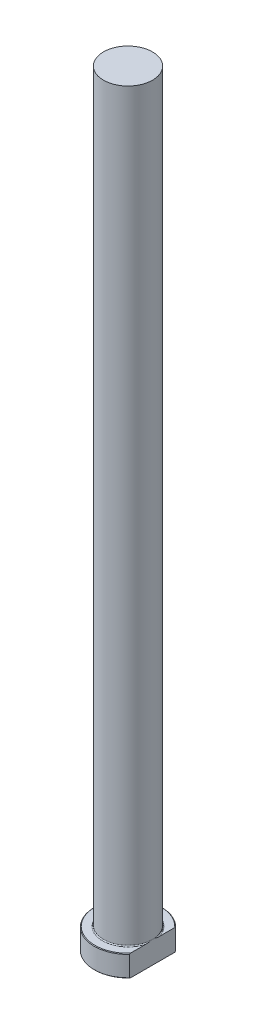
from build123d import *
from build123d.topology import SkipClean

# Parameters (mm, degrees)
CHAMFER1_SIZE = 0.2
FILLET1_R     = 0.3
KEY_DEPTH     = 251.483532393


with BuildPart() as part:
    # Sketch1 → Revolve1 (revolve)
    with BuildSketch(Plane.XY, mode=Mode.PRIVATE) as revolve1_sk:
        Polygon((0, 0), (-11, 0), (-11, 7), (-8, 7), (-8, 250), (0, 250), align=None)
    revolve(revolve1_sk.sketch.rotate(Axis((0, 259.958771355, 0), (0, -1, 0)), 270), axis=Axis((0, 259.958771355, 0), (0, -1, 0)))

    # Chamfer1
    chamfer1_edges = [part.edges().sort_by_distance(p)[0] for p in [
        (0, 7, -11),
        (0, 0, -11),
    ]]
    chamfer(chamfer1_edges, length=CHAMFER1_SIZE)

    # Fillet1
    fillet1_edges = [part.edges().sort_by_distance(p)[0] for p in [
        (0, 7, -8),
    ]]
    fillet(fillet1_edges, radius=FILLET1_R)

    # Sketch2 → KEY (cut, through all)
    with SkipClean():  # the faces are left unmerged after this step: merging them gives an invalid solid
        with BuildSketch(Plane(origin=(0, 0, 0), x_dir=(1, 0, 0), z_dir=(0, 1, 0))):
            with BuildLine():
                Line((8, 7.549834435), (8, -7.549834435))
                ThreePointArc((8, -7.549834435), (11, 0), (8, 7.549834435))
            make_face()
        extrude(amount=KEY_DEPTH, mode=Mode.SUBTRACT)


solid = part.part
